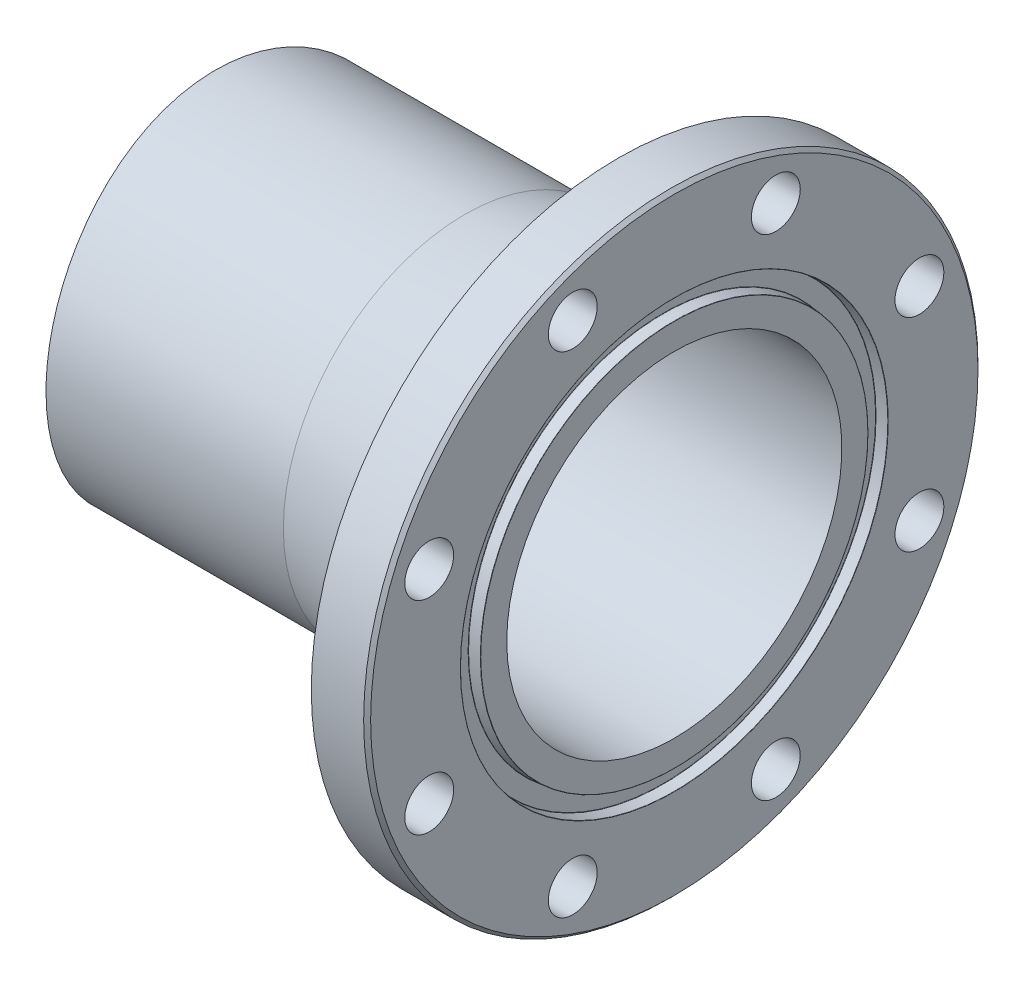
from build123d import *

# Parameters (mm, degrees)
SKETCH2_R          = 609.6
CUT_EXTRUDE1_DEPTH = 139.7
CIRPATTERN1_COUNT  = 8
CHAMFER1_SIZE      = 1.5875
FILLET1_R          = 9.525


with BuildPart() as part:
    # Sketch1 → Revolve1 (revolve)
    with BuildSketch(Plane(origin=(0, 0, 0), x_dir=(1, 0, 0), z_dir=(0, 1, 0)), mode=Mode.PRIVATE) as revolve1_sk:
        with BuildLine():
            Line((0, 76.2), (247.65, 76.2))
            Line((247.65, 76.2), (247.65, 88.019461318))
            ThreePointArc((247.65, 88.019461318), (247.616634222, 88.105261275), (247.534068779, 88.145978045))
            Line((247.534068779, 88.145978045), (242.660531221, 88.572357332))
            ThreePointArc((242.660531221, 88.572357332), (242.577965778, 88.613074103), (242.5446, 88.698874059))
            Line((242.5446, 88.698874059), (242.5446, 96.644925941))
            ThreePointArc((242.5446, 96.644925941), (242.577965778, 96.730725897), (242.660531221, 96.771442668))
            Line((242.660531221, 96.771442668), (247.534068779, 97.197821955))
            ThreePointArc((247.534068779, 97.197821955), (247.616634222, 97.238538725), (247.65, 97.324338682))
            Line((247.65, 97.324338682), (247.65, 139.7))
            Line((247.65, 139.7), (222.25, 139.7))
            Line((222.25, 139.7), (222.25, 95.25))
            Line((222.25, 95.25), (152.4, 82.55))
            Line((152.4, 82.55), (0, 82.55))
            Line((0, 82.55), (0, 76.2))
        make_face()
    revolve(revolve1_sk.sketch.rotate(Axis((0, 0, 0), (1, 0, 0)), 180), axis=Axis((0, 0, 0), (1, 0, 0)))

    # Sketch2 → Cut-Extrude1 (cut, symmetric)
    with BuildSketch(Plane.XY):
        with Locations((-565.15, 0)):
            Circle(SKETCH2_R)
    extrude(amount=CUT_EXTRUDE1_DEPTH, both=True, mode=Mode.SUBTRACT)

    # Sketch4 → 7_8 _0.875_ Diameter Hole1 (revolve, cut)
    with BuildSketch(Plane(origin=(247.65, 46.170756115, 111.466065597), x_dir=(0, 0, -1), z_dir=(0, 1, 0))):
        Polygon((0, 0), (0, 82.877063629), (11.1125, 76.2), (11.1125, 0), align=None)
    f_7_8_0_875_diameter_hole1 = revolve(axis=Axis((254, 46.170756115, 111.466065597), (-1, 0, 0)), mode=Mode.SUBTRACT)

    # CirPattern1: 7_8 _0.875_ Diameter Hole1 ×8 about axis
    cirpattern1_axis = Axis((0, 0, 0), (1, 0, 0))
    for i in range(1, CIRPATTERN1_COUNT):
        add(f_7_8_0_875_diameter_hole1.rotate(cirpattern1_axis, i * 360 / CIRPATTERN1_COUNT), mode=Mode.SUBTRACT)

    # Chamfer1
    chamfer1_edges = [part.edges().sort_by_distance(p)[0] for p in [
        (247.65, 0, -139.7),
    ]]
    chamfer(chamfer1_edges, length=CHAMFER1_SIZE)

    # Fillet1
    fillet1_edges = [part.edges().sort_by_distance(p)[0] for p in [
        (222.25, 0, -95.25),
    ]]
    fillet(fillet1_edges, radius=FILLET1_R)


solid = part.part
